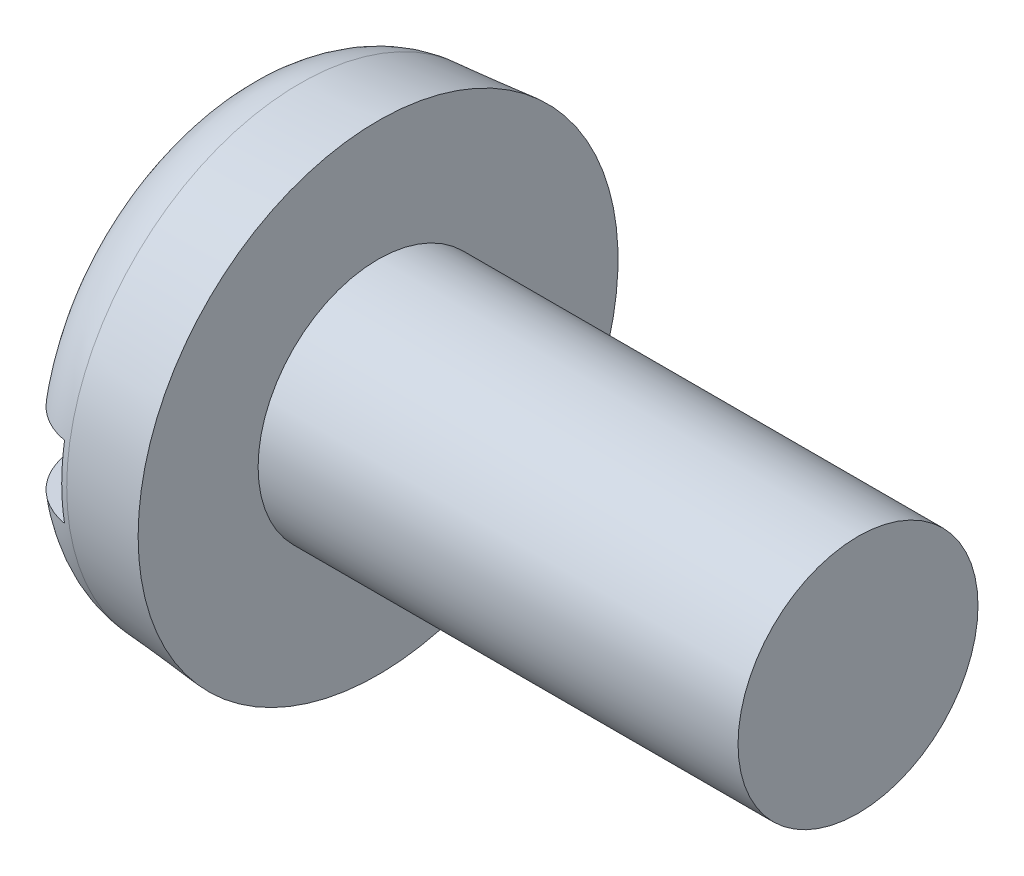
from build123d import *

# Parameters (mm, degrees)
FILLET2_R  = 1.2
SKETCH2_W  = 8
SKETCH2_H  = 1.2
SLOT_DEPTH = 1


with BuildPart() as part:
    # BodySke → Base-Revolve (revolve)
    with BuildSketch(Plane.XY, mode=Mode.PRIVATE) as base_revolve_sk:
        Polygon((2.4, 2), (2.4, 4), (0, 3.790027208), (0, 0), (10.4, 0), (10.4, 2), align=None)
    revolve(base_revolve_sk.sketch.rotate(Axis((-25.4, 0, 0), (1, 0, 0)), 90), axis=Axis((-25.4, 0, 0), (1, 0, 0)))

    # Fillet2
    fillet2_edges = [part.edges().sort_by_distance(p)[0] for p in [
        (0, 0, -3.790027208),
    ]]
    fillet(fillet2_edges, radius=FILLET2_R)

    # Sketch2 → Slot (cut)
    with BuildSketch(Plane(origin=(0, 0, 0), x_dir=(0, 0, -1), z_dir=(1, 0, 0))):
        Rectangle(SKETCH2_W, SKETCH2_H)
    extrude(amount=SLOT_DEPTH, mode=Mode.SUBTRACT)


solid = part.part
